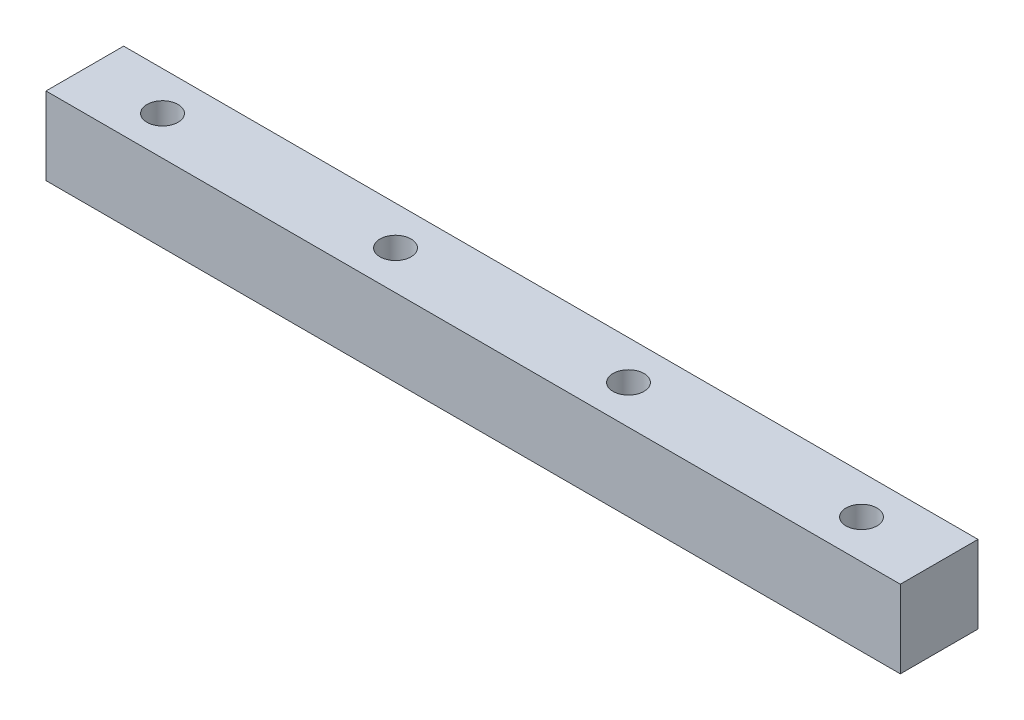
from build123d import *

# Parameters (mm, degrees)
ESQUISSE1_W                = 110
ESQUISSE1_H                = 10
BOSS_EXTRU_1_DEPTH         = 10
ESQUISSE2_R                = 2
ENL_V_MAT_EXTRU_1_DEPTH    = 10
R_P_TITION_LIN_AIRE1_COUNT = 4
R_P_TITION_LIN_AIRE1_PITCH = 30


with BuildPart() as part:
    # Esquisse1 → Boss.-Extru.1 (new body)
    with BuildSketch(Plane.XY):
        with Locations((55, 5)):
            Rectangle(ESQUISSE1_W, ESQUISSE1_H)
    extrude(amount=BOSS_EXTRU_1_DEPTH)

    # Esquisse2 → Enl_v. mat.-Extru.1 (cut)
    with BuildSketch(Plane(origin=(0, 10, 0), x_dir=(1, 0, 0), z_dir=(0, 1, 0))):
        with Locations(Location((10, -5, 0), (0, 0, 270))):
            Circle(ESQUISSE2_R)
    enl_v_mat_extru_1 = extrude(amount=-ENL_V_MAT_EXTRU_1_DEPTH, mode=Mode.SUBTRACT)

    # R_p_tition lin_aire1: Enl_v. mat.-Extru.1 ×4
    with Locations(*[(i * R_P_TITION_LIN_AIRE1_PITCH, 0, 0) for i in range(1, R_P_TITION_LIN_AIRE1_COUNT)]):
        add(enl_v_mat_extru_1, mode=Mode.SUBTRACT)


solid = part.part
